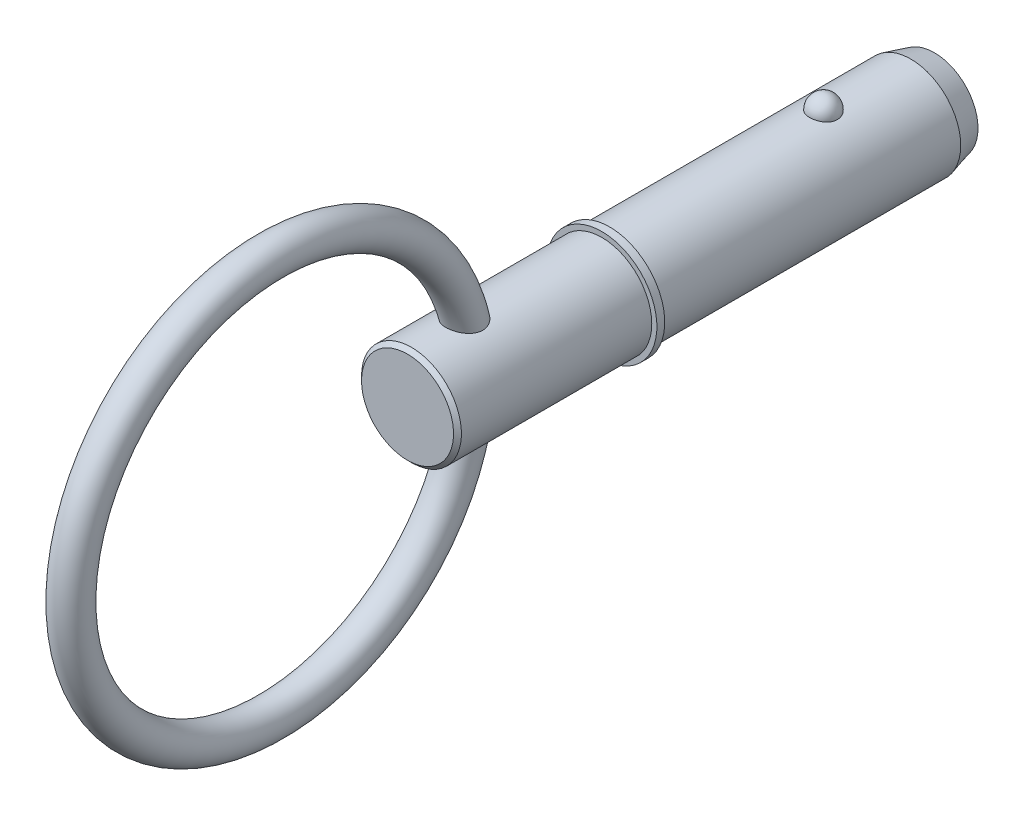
from build123d import *

# Parameters (mm, degrees)
SKETCH2_R           = 6.35
BOSS_EXTRUDE1_DEPTH = 25.4
BOSS_EXTRUDE2_START = 15.88
SKETCH3_R           = 6.35
BOSS_EXTRUDE2_DEPTH = 15.88
CHAMFER1_SIZE       = 3
CHAMFER1_SIZE2      = 0.803847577
SKETCH20_W          = 1
SKETCH20_H          = 7
SKETCH21_R          = 6.35
BOSS_EXTRUDE3_DEPTH = 25.7
CHAMFER2_SIZE       = 0.5
SKETCH24_R          = 2.25


with BuildPart() as part:
    # Sketch2 → Boss-Extrude1 (new body)
    with BuildSketch(Plane.XY):
        Circle(SKETCH2_R)
    extrude(amount=BOSS_EXTRUDE1_DEPTH)

    # Sketch3 → Boss-Extrude2 (add)
    with BuildSketch(Plane(origin=(0, 0, 0), x_dir=(-1, 0, 0), z_dir=(0, 0, -1)).offset(BOSS_EXTRUDE2_START)):
        Circle(SKETCH3_R)
    extrude(amount=-BOSS_EXTRUDE2_DEPTH)

    # Chamfer1
    chamfer1_edges = [part.edges().sort_by_distance(p)[0] for p in [
        (6.35, 0, -15.88),
    ]]
    chamfer1_side = [part.faces().sort_by_distance(p)[0] for p in [
        (6.35, 0, -7.94),
    ]]
    chamfer(chamfer1_edges, length=CHAMFER1_SIZE, length2=CHAMFER1_SIZE2, reference=chamfer1_side[0])

    # Sketch18 → Revolve1 (revolve)
    with BuildSketch(Plane(origin=(0, 0, 0), x_dir=(0, 0, -1), z_dir=(1, 0, 0))):
        with BuildLine():
            Line((1.78, 8.13), (1.78, 4.57))
            ThreePointArc((1.78, 4.57), (0, 6.35), (1.78, 8.13))
        make_face()
    revolve(axis=Axis((0, 8.13, -1.78), (0, -1, 0)))

    # Sketch20 → Revolve2 (revolve)
    with BuildSketch(Plane(origin=(0, 0, 0), x_dir=(0, 0, -1), z_dir=(1, 0, 0)), mode=Mode.PRIVATE) as revolve2_sk:
        with Locations((-25.9, 3.5)):
            Rectangle(SKETCH20_W, SKETCH20_H)
    revolve(revolve2_sk.sketch.rotate(Axis((0, 0, 33.728787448), (0, 0, 1)), 270), axis=Axis((0, 0, 33.728787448), (0, 0, 1)))

    # Sketch21 → Boss-Extrude3 (add)
    with BuildSketch(Plane(origin=(0, 0, 25.4), x_dir=(-1, 0, 0), z_dir=(0, 0, -1))):
        with Locations(Location((0, 0, 0), (0, 0, 180))):
            Circle(SKETCH21_R)
    extrude(amount=-BOSS_EXTRUDE3_DEPTH)

    # Chamfer2
    chamfer2_edges = [part.edges().sort_by_distance(p)[0] for p in [
        (-6.35, 0, 51.1),
    ]]
    chamfer(chamfer2_edges, length=CHAMFER2_SIZE)

    # Sweep1: sweep along a path in Sketch23
    with BuildLine(Plane(origin=(0, 0, 0), x_dir=(0, 0, -1), z_dir=(1, 0, 0))) as sweep1_path:
        CenterArc((-68.5, 0), 25.4, 0, 360)
    # Sketch24 → Sweep1 (sweep)
    with BuildSketch(Plane(origin=(0, 0, 0), x_dir=(1, 0, 0), z_dir=(0, 1, 0))):
        with Locations((0, -43.1)):
            Circle(SKETCH24_R)
    sweep(path=sweep1_path.line)


solid = part.part
